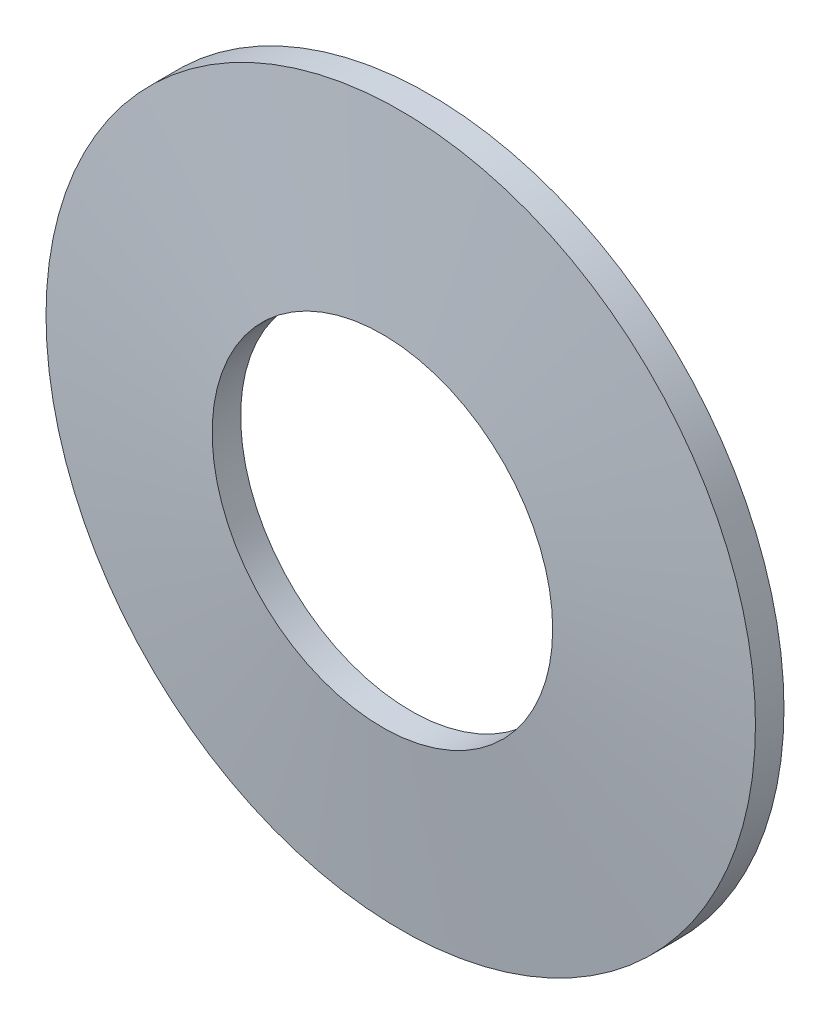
ISO-10303-21;
HEADER;
FILE_DESCRIPTION(('STEP AP214'),'2;1');
FILE_NAME('part.step','',(''),(''),'','','');
FILE_SCHEMA(('AUTOMOTIVE_DESIGN { 1 0 10303 214 1 1 1 1 }'));
ENDSEC;
DATA;
#1=APPLICATION_CONTEXT('core data for automotive mechanical design processes');
#2=APPLICATION_PROTOCOL_DEFINITION('international standard','automotive_design',2000,#1);
#3=PRODUCT_CONTEXT('',#1,'mechanical');
#4=PRODUCT('Part','Part','',(#3));
#5=PRODUCT_RELATED_PRODUCT_CATEGORY('part','',(#4));
#6=PRODUCT_DEFINITION_FORMATION('','',#4);
#7=PRODUCT_DEFINITION_CONTEXT('part definition',#1,'design');
#8=PRODUCT_DEFINITION('design','',#6,#7);
#9=PRODUCT_DEFINITION_SHAPE('','',#8);
#10=(LENGTH_UNIT() NAMED_UNIT(*) SI_UNIT(.MILLI.,.METRE.));
#11=(NAMED_UNIT(*) PLANE_ANGLE_UNIT() SI_UNIT($,.RADIAN.));
#12=(NAMED_UNIT(*) SI_UNIT($,.STERADIAN.) SOLID_ANGLE_UNIT());
#13=UNCERTAINTY_MEASURE_WITH_UNIT(LENGTH_MEASURE(1.E-05),#10,'distance_accuracy_value','');
#14=(GEOMETRIC_REPRESENTATION_CONTEXT(3) GLOBAL_UNCERTAINTY_ASSIGNED_CONTEXT((#13)) GLOBAL_UNIT_ASSIGNED_CONTEXT((#10,
#11,#12)) REPRESENTATION_CONTEXT('',''));
#15=CARTESIAN_POINT('',(0.,0.,0.));
#16=DIRECTION('',(0.,0.,1.));
#17=DIRECTION('',(1.,0.,0.));
#18=AXIS2_PLACEMENT_3D('',#15,#16,#17);
#19=CARTESIAN_POINT('',(0.,0.,0.999999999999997));
#20=DIRECTION('',(0.,0.,-1.));
#21=DIRECTION('',(-1.,0.,0.));
#22=AXIS2_PLACEMENT_3D('',#19,#20,#21);
#23=CONICAL_SURFACE('',#22,12.5,1.47175594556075);
#24=CARTESIAN_POINT('',(0.,0.,1.64587565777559));
#25=DIRECTION('',(0.,0.,1.));
#26=DIRECTION('',(1.,0.,0.));
#27=AXIS2_PLACEMENT_3D('',#24,#25,#26);
#28=CIRCLE('',#27,6.);
#29=CARTESIAN_POINT('',(6.,0.,1.64587565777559));
#30=VERTEX_POINT('',#29);
#31=EDGE_CURVE('E8',#30,#30,#28,.T.);
#32=ORIENTED_EDGE('',*,*,#31,.F.);
#33=EDGE_LOOP('',(#32));
#34=FACE_BOUND('',#33,.T.);
#35=CARTESIAN_POINT('',(0.,0.,0.999999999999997));
#36=DIRECTION('',(0.,0.,1.));
#37=DIRECTION('',(1.,0.,0.));
#38=AXIS2_PLACEMENT_3D('',#35,#36,#37);
#39=CIRCLE('',#38,12.5);
#40=CARTESIAN_POINT('',(12.5,0.,0.999999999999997));
#41=VERTEX_POINT('',#40);
#42=EDGE_CURVE('E26',#41,#41,#39,.T.);
#43=ORIENTED_EDGE('',*,*,#42,.T.);
#44=EDGE_LOOP('',(#43));
#45=FACE_BOUND('',#44,.T.);
#46=ADVANCED_FACE('F12',(#34,#45),#23,.T.);
#47=CARTESIAN_POINT('',(0.,0.,22.5));
#48=DIRECTION('',(0.,0.,1.));
#49=DIRECTION('',(1.,0.,0.));
#50=AXIS2_PLACEMENT_3D('',#47,#48,#49);
#51=CYLINDRICAL_SURFACE('',#50,6.);
#52=CARTESIAN_POINT('',(0.,0.,0.640951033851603));
#53=DIRECTION('',(0.,0.,1.));
#54=DIRECTION('',(1.,0.,0.));
#55=AXIS2_PLACEMENT_3D('',#52,#53,#54);
#56=CIRCLE('',#55,6.);
#57=CARTESIAN_POINT('',(6.,0.,0.640951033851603));
#58=VERTEX_POINT('',#57);
#59=EDGE_CURVE('E18',#58,#58,#56,.T.);
#60=ORIENTED_EDGE('',*,*,#59,.F.);
#61=EDGE_LOOP('',(#60));
#62=FACE_BOUND('',#61,.T.);
#63=ORIENTED_EDGE('',*,*,#31,.T.);
#64=EDGE_LOOP('',(#63));
#65=FACE_BOUND('',#64,.T.);
#66=ADVANCED_FACE('F41',(#62,#65),#51,.F.);
#67=CARTESIAN_POINT('',(0.,0.,0.640951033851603));
#68=DIRECTION('',(0.,0.,-1.));
#69=DIRECTION('',(-1.,0.,0.));
#70=AXIS2_PLACEMENT_3D('',#67,#68,#69);
#71=CONICAL_SURFACE('',#70,6.,1.47175594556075);
#72=CARTESIAN_POINT('',(0.,0.,-0.00492462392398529));
#73=DIRECTION('',(0.,0.,1.));
#74=DIRECTION('',(1.,0.,0.));
#75=AXIS2_PLACEMENT_3D('',#72,#73,#74);
#76=CIRCLE('',#75,12.5);
#77=CARTESIAN_POINT('',(12.5,0.,-0.00492462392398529));
#78=VERTEX_POINT('',#77);
#79=EDGE_CURVE('E22',#78,#78,#76,.T.);
#80=ORIENTED_EDGE('',*,*,#79,.F.);
#81=EDGE_LOOP('',(#80));
#82=FACE_BOUND('',#81,.T.);
#83=ORIENTED_EDGE('',*,*,#59,.T.);
#84=EDGE_LOOP('',(#83));
#85=FACE_BOUND('',#84,.T.);
#86=ADVANCED_FACE('F36',(#82,#85),#71,.F.);
#87=CARTESIAN_POINT('',(0.,0.,22.5));
#88=DIRECTION('',(0.,0.,1.));
#89=DIRECTION('',(1.,0.,0.));
#90=AXIS2_PLACEMENT_3D('',#87,#88,#89);
#91=CYLINDRICAL_SURFACE('',#90,12.5);
#92=ORIENTED_EDGE('',*,*,#42,.F.);
#93=EDGE_LOOP('',(#92));
#94=FACE_BOUND('',#93,.T.);
#95=ORIENTED_EDGE('',*,*,#79,.T.);
#96=EDGE_LOOP('',(#95));
#97=FACE_BOUND('',#96,.T.);
#98=ADVANCED_FACE('F33',(#94,#97),#91,.T.);
#99=CLOSED_SHELL('',(#46,#66,#86,#98));
#100=MANIFOLD_SOLID_BREP('B1',#99);
#101=ADVANCED_BREP_SHAPE_REPRESENTATION('',(#18,#100),#14);
#102=SHAPE_DEFINITION_REPRESENTATION(#9,#101);
ENDSEC;
END-ISO-10303-21;
